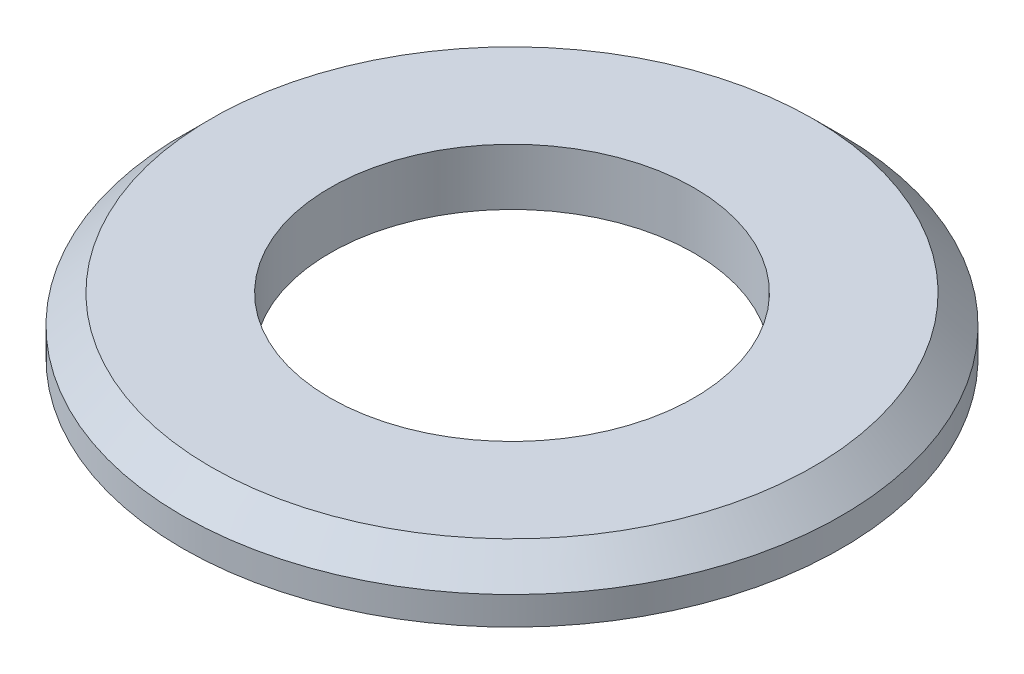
from build123d import *

# Parameters (mm, degrees)
SKETCH1_R      = 52.5
SKETCH1_R_2    = 29
EXTRUDE1_DEPTH = 9
CHAMFER1_SIZE  = 4.5


with BuildPart() as part:
    # Sketch1 → Extrude1 (new body)
    with BuildSketch(Plane(origin=(0, 0, 0), x_dir=(1, 0, 0), z_dir=(0, 1, 0))):
        with Locations(Location((0, 0, 0), (0, 0, 270))):
            Circle(SKETCH1_R)
        with Locations(Location((0, 0, 0), (0, 0, 270))):
            Circle(SKETCH1_R_2, mode=Mode.SUBTRACT)
    extrude(amount=EXTRUDE1_DEPTH)

    # Chamfer1
    chamfer1_edges = [part.edges().sort_by_distance(p)[0] for p in [
        (0, 9, -52.5),
    ]]
    chamfer(chamfer1_edges, length=CHAMFER1_SIZE)


solid = part.part
